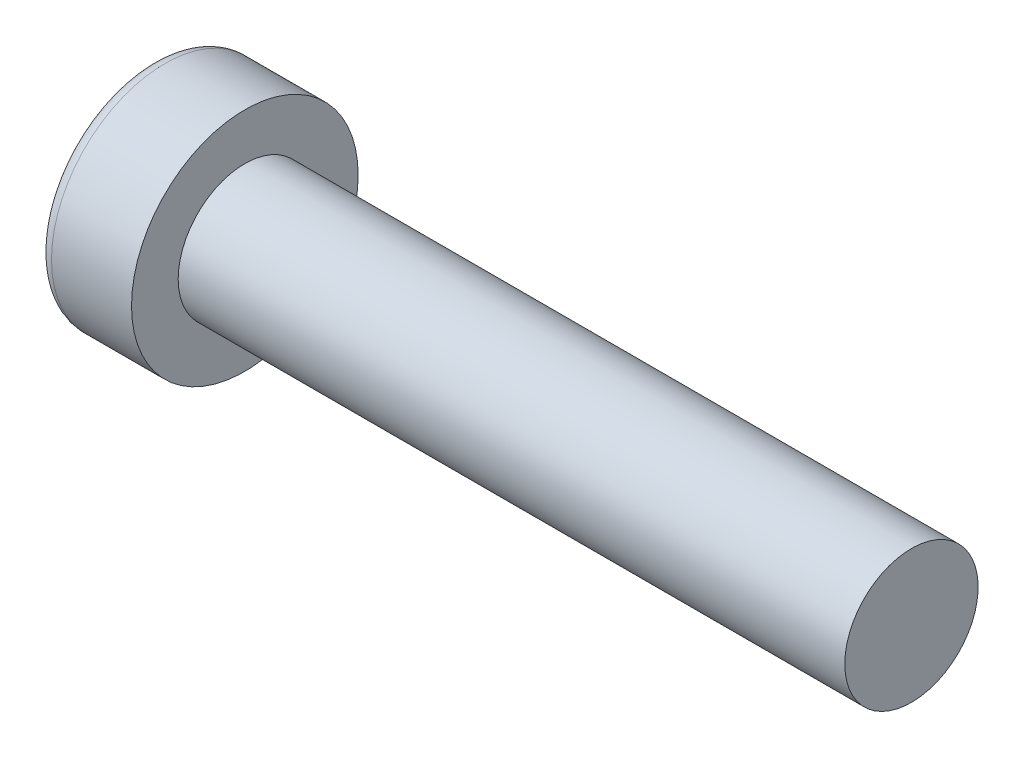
ISO-10303-21;
HEADER;
FILE_DESCRIPTION(('STEP AP214'),'2;1');
FILE_NAME('part.step','',(''),(''),'','','');
FILE_SCHEMA(('AUTOMOTIVE_DESIGN { 1 0 10303 214 1 1 1 1 }'));
ENDSEC;
DATA;
#1=APPLICATION_CONTEXT('core data for automotive mechanical design processes');
#2=APPLICATION_PROTOCOL_DEFINITION('international standard','automotive_design',2000,#1);
#3=PRODUCT_CONTEXT('',#1,'mechanical');
#4=PRODUCT('Part','Part','',(#3));
#5=PRODUCT_RELATED_PRODUCT_CATEGORY('part','',(#4));
#6=PRODUCT_DEFINITION_FORMATION('','',#4);
#7=PRODUCT_DEFINITION_CONTEXT('part definition',#1,'design');
#8=PRODUCT_DEFINITION('design','',#6,#7);
#9=PRODUCT_DEFINITION_SHAPE('','',#8);
#10=(LENGTH_UNIT() NAMED_UNIT(*) SI_UNIT(.MILLI.,.METRE.));
#11=(NAMED_UNIT(*) PLANE_ANGLE_UNIT() SI_UNIT($,.RADIAN.));
#12=(NAMED_UNIT(*) SI_UNIT($,.STERADIAN.) SOLID_ANGLE_UNIT());
#13=UNCERTAINTY_MEASURE_WITH_UNIT(LENGTH_MEASURE(1.E-05),#10,'distance_accuracy_value','');
#14=(GEOMETRIC_REPRESENTATION_CONTEXT(3) GLOBAL_UNCERTAINTY_ASSIGNED_CONTEXT((#13)) GLOBAL_UNIT_ASSIGNED_CONTEXT((#10,
#11,#12)) REPRESENTATION_CONTEXT('',''));
#15=CARTESIAN_POINT('',(0.,0.,0.));
#16=DIRECTION('',(0.,0.,1.));
#17=DIRECTION('',(1.,0.,0.));
#18=AXIS2_PLACEMENT_3D('',#15,#16,#17);
#19=CARTESIAN_POINT('',(-25.,4.25,0.));
#20=DIRECTION('',(-1.,0.,0.));
#21=DIRECTION('',(0.,0.,1.));
#22=AXIS2_PLACEMENT_3D('',#19,#20,#21);
#23=PLANE('',#22);
#24=CARTESIAN_POINT('',(-25.,0.,0.));
#25=DIRECTION('',(-1.,0.,0.));
#26=DIRECTION('',(0.,0.,1.));
#27=AXIS2_PLACEMENT_3D('',#24,#25,#26);
#28=CIRCLE('',#27,4.25);
#29=CARTESIAN_POINT('',(-25.,0.,4.25));
#30=VERTEX_POINT('',#29);
#31=EDGE_CURVE('E148',#30,#30,#28,.T.);
#32=ORIENTED_EDGE('',*,*,#31,.F.);
#33=EDGE_LOOP('',(#32));
#34=FACE_BOUND('',#33,.T.);
#35=CARTESIAN_POINT('',(-25.,0.,0.));
#36=DIRECTION('',(-1.,0.,0.));
#37=DIRECTION('',(0.,0.,1.));
#38=AXIS2_PLACEMENT_3D('',#35,#36,#37);
#39=CIRCLE('',#38,2.5);
#40=CARTESIAN_POINT('',(-25.,0.,2.5));
#41=VERTEX_POINT('',#40);
#42=EDGE_CURVE('E137',#41,#41,#39,.T.);
#43=ORIENTED_EDGE('',*,*,#42,.T.);
#44=EDGE_LOOP('',(#43));
#45=FACE_BOUND('',#44,.T.);
#46=ADVANCED_FACE('F35',(#34,#45),#23,.F.);
#47=CARTESIAN_POINT('',(-65.0118083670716,0.,0.));
#48=DIRECTION('',(-1.,0.,0.));
#49=DIRECTION('',(0.,0.,1.));
#50=AXIS2_PLACEMENT_3D('',#47,#48,#49);
#51=CYLINDRICAL_SURFACE('',#50,4.25);
#52=CARTESIAN_POINT('',(-28.,0.,0.));
#53=DIRECTION('',(1.,0.,0.));
#54=DIRECTION('',(0.,0.,-1.));
#55=AXIS2_PLACEMENT_3D('',#52,#53,#54);
#56=CIRCLE('',#55,4.25);
#57=CARTESIAN_POINT('',(-28.,0.,-4.25));
#58=VERTEX_POINT('',#57);
#59=EDGE_CURVE('E11',#58,#58,#56,.T.);
#60=ORIENTED_EDGE('',*,*,#59,.T.);
#61=EDGE_LOOP('',(#60));
#62=FACE_BOUND('',#61,.T.);
#63=ORIENTED_EDGE('',*,*,#31,.T.);
#64=EDGE_LOOP('',(#63));
#65=FACE_BOUND('',#64,.T.);
#66=ADVANCED_FACE('F170',(#62,#65),#51,.T.);
#67=CARTESIAN_POINT('',(-28.5,0.,0.));
#68=DIRECTION('',(1.,0.,0.));
#69=DIRECTION('',(0.,0.,-1.));
#70=AXIS2_PLACEMENT_3D('',#67,#68,#69);
#71=PLANE('',#70);
#72=DIRECTION('',(0.,0.5,-0.866025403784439));
#73=VECTOR('',#72,1.);
#74=CARTESIAN_POINT('',(-28.5,1.15470053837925,2.));
#75=LINE('',#74,#73);
#76=CARTESIAN_POINT('',(-28.5,1.15470053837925,2.));
#77=VERTEX_POINT('',#76);
#78=CARTESIAN_POINT('',(-28.5,2.3094010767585,0.));
#79=VERTEX_POINT('',#78);
#80=EDGE_CURVE('E124',#77,#79,#75,.T.);
#81=ORIENTED_EDGE('',*,*,#80,.F.);
#82=DIRECTION('',(0.,1.,0.));
#83=VECTOR('',#82,1.);
#84=CARTESIAN_POINT('',(-28.5,-1.15470053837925,2.));
#85=LINE('',#84,#83);
#86=CARTESIAN_POINT('',(-28.5,-1.15470053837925,2.));
#87=VERTEX_POINT('',#86);
#88=EDGE_CURVE('E50',#87,#77,#85,.T.);
#89=ORIENTED_EDGE('',*,*,#88,.F.);
#90=DIRECTION('',(0.,0.5,0.866025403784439));
#91=VECTOR('',#90,1.);
#92=CARTESIAN_POINT('',(-28.5,-2.3094010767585,0.));
#93=LINE('',#92,#91);
#94=CARTESIAN_POINT('',(-28.5,-2.3094010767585,0.));
#95=VERTEX_POINT('',#94);
#96=EDGE_CURVE('E133',#95,#87,#93,.T.);
#97=ORIENTED_EDGE('',*,*,#96,.F.);
#98=DIRECTION('',(0.,-0.5,0.866025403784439));
#99=VECTOR('',#98,1.);
#100=CARTESIAN_POINT('',(-28.5,-1.15470053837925,-2.));
#101=LINE('',#100,#99);
#102=CARTESIAN_POINT('',(-28.5,-1.15470053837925,-2.));
#103=VERTEX_POINT('',#102);
#104=EDGE_CURVE('E131',#103,#95,#101,.T.);
#105=ORIENTED_EDGE('',*,*,#104,.F.);
#106=DIRECTION('',(0.,-1.,0.));
#107=VECTOR('',#106,1.);
#108=CARTESIAN_POINT('',(-28.5,1.15470053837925,-2.));
#109=LINE('',#108,#107);
#110=CARTESIAN_POINT('',(-28.5,1.15470053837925,-2.));
#111=VERTEX_POINT('',#110);
#112=EDGE_CURVE('E98',#111,#103,#109,.T.);
#113=ORIENTED_EDGE('',*,*,#112,.F.);
#114=DIRECTION('',(0.,-0.5,-0.866025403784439));
#115=VECTOR('',#114,1.);
#116=CARTESIAN_POINT('',(-28.5,2.3094010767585,0.));
#117=LINE('',#116,#115);
#118=EDGE_CURVE('E127',#79,#111,#117,.T.);
#119=ORIENTED_EDGE('',*,*,#118,.F.);
#120=EDGE_LOOP('',(#81,#89,#97,#105,#113,#119));
#121=FACE_BOUND('',#120,.T.);
#122=CARTESIAN_POINT('',(-28.5,0.,0.));
#123=DIRECTION('',(1.,0.,0.));
#124=DIRECTION('',(0.,0.,-1.));
#125=AXIS2_PLACEMENT_3D('',#122,#123,#124);
#126=CIRCLE('',#125,3.75);
#127=CARTESIAN_POINT('',(-28.5,0.,-3.75));
#128=VERTEX_POINT('',#127);
#129=EDGE_CURVE('E43',#128,#128,#126,.F.);
#130=ORIENTED_EDGE('',*,*,#129,.T.);
#131=EDGE_LOOP('',(#130));
#132=FACE_BOUND('',#131,.T.);
#133=ADVANCED_FACE('F153',(#121,#132),#71,.F.);
#134=CARTESIAN_POINT('',(0.,2.5,0.));
#135=DIRECTION('',(-1.,0.,0.));
#136=DIRECTION('',(0.,0.,1.));
#137=AXIS2_PLACEMENT_3D('',#134,#135,#136);
#138=PLANE('',#137);
#139=CARTESIAN_POINT('',(0.,0.,0.));
#140=DIRECTION('',(-1.,0.,0.));
#141=DIRECTION('',(0.,0.,1.));
#142=AXIS2_PLACEMENT_3D('',#139,#140,#141);
#143=CIRCLE('',#142,2.5);
#144=CARTESIAN_POINT('',(0.,0.,2.5));
#145=VERTEX_POINT('',#144);
#146=EDGE_CURVE('E145',#145,#145,#143,.T.);
#147=ORIENTED_EDGE('',*,*,#146,.F.);
#148=EDGE_LOOP('',(#147));
#149=FACE_BOUND('',#148,.T.);
#150=ADVANCED_FACE('F165',(#149),#138,.F.);
#151=CARTESIAN_POINT('',(-65.0118083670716,0.,0.));
#152=DIRECTION('',(-1.,0.,0.));
#153=DIRECTION('',(0.,0.,1.));
#154=AXIS2_PLACEMENT_3D('',#151,#152,#153);
#155=CYLINDRICAL_SURFACE('',#154,2.5);
#156=ORIENTED_EDGE('',*,*,#42,.F.);
#157=EDGE_LOOP('',(#156));
#158=FACE_BOUND('',#157,.T.);
#159=ORIENTED_EDGE('',*,*,#146,.T.);
#160=EDGE_LOOP('',(#159));
#161=FACE_BOUND('',#160,.T.);
#162=ADVANCED_FACE('F157',(#158,#161),#155,.T.);
#163=CARTESIAN_POINT('',(-28.,0.,0.));
#164=DIRECTION('',(1.,0.,0.));
#165=DIRECTION('',(0.,0.,-1.));
#166=AXIS2_PLACEMENT_3D('',#163,#164,#165);
#167=TOROIDAL_SURFACE('',#166,3.75,0.5);
#168=ORIENTED_EDGE('',*,*,#59,.F.);
#169=EDGE_LOOP('',(#168));
#170=FACE_BOUND('',#169,.T.);
#171=ORIENTED_EDGE('',*,*,#129,.F.);
#172=EDGE_LOOP('',(#171));
#173=FACE_BOUND('',#172,.T.);
#174=ADVANCED_FACE('F37',(#170,#173),#167,.T.);
#175=CARTESIAN_POINT('',(-25.5,-1.15470053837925,2.));
#176=DIRECTION('',(0.,0.,1.));
#177=DIRECTION('',(1.,0.,0.));
#178=AXIS2_PLACEMENT_3D('',#175,#176,#177);
#179=PLANE('',#178);
#180=ORIENTED_EDGE('',*,*,#88,.T.);
#181=DIRECTION('',(-1.,0.,0.));
#182=VECTOR('',#181,1.);
#183=CARTESIAN_POINT('',(-25.5,1.15470053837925,2.));
#184=LINE('',#183,#182);
#185=CARTESIAN_POINT('',(-25.5,1.15470053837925,2.));
#186=VERTEX_POINT('',#185);
#187=EDGE_CURVE('E80',#186,#77,#184,.T.);
#188=ORIENTED_EDGE('',*,*,#187,.F.);
#189=DIRECTION('',(0.,1.,0.));
#190=VECTOR('',#189,1.);
#191=CARTESIAN_POINT('',(-25.5,-1.15470053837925,2.));
#192=LINE('',#191,#190);
#193=CARTESIAN_POINT('',(-25.5,-1.15470053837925,2.));
#194=VERTEX_POINT('',#193);
#195=EDGE_CURVE('E135',#194,#186,#192,.T.);
#196=ORIENTED_EDGE('',*,*,#195,.F.);
#197=DIRECTION('',(-1.,0.,0.));
#198=VECTOR('',#197,1.);
#199=CARTESIAN_POINT('',(-25.5,-1.15470053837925,2.));
#200=LINE('',#199,#198);
#201=EDGE_CURVE('E58',#194,#87,#200,.T.);
#202=ORIENTED_EDGE('',*,*,#201,.T.);
#203=EDGE_LOOP('',(#180,#188,#196,#202));
#204=FACE_BOUND('',#203,.T.);
#205=ADVANCED_FACE('F156',(#204),#179,.F.);
#206=CARTESIAN_POINT('',(-25.5,-2.3094010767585,0.));
#207=DIRECTION('',(0.,-0.866025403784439,0.5));
#208=DIRECTION('',(0.,-0.5,-0.866025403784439));
#209=AXIS2_PLACEMENT_3D('',#206,#207,#208);
#210=PLANE('',#209);
#211=ORIENTED_EDGE('',*,*,#96,.T.);
#212=ORIENTED_EDGE('',*,*,#201,.F.);
#213=DIRECTION('',(0.,0.5,0.866025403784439));
#214=VECTOR('',#213,1.);
#215=CARTESIAN_POINT('',(-25.5,-2.3094010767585,0.));
#216=LINE('',#215,#214);
#217=CARTESIAN_POINT('',(-25.5,-2.3094010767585,0.));
#218=VERTEX_POINT('',#217);
#219=EDGE_CURVE('E110',#218,#194,#216,.T.);
#220=ORIENTED_EDGE('',*,*,#219,.F.);
#221=DIRECTION('',(-1.,0.,0.));
#222=VECTOR('',#221,1.);
#223=CARTESIAN_POINT('',(-25.5,-2.3094010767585,0.));
#224=LINE('',#223,#222);
#225=EDGE_CURVE('E102',#218,#95,#224,.T.);
#226=ORIENTED_EDGE('',*,*,#225,.T.);
#227=EDGE_LOOP('',(#211,#212,#220,#226));
#228=FACE_BOUND('',#227,.T.);
#229=ADVANCED_FACE('F163',(#228),#210,.F.);
#230=CARTESIAN_POINT('',(-25.5,-1.15470053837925,-2.));
#231=DIRECTION('',(0.,-0.866025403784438,-0.5));
#232=DIRECTION('',(0.,0.5,-0.866025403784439));
#233=AXIS2_PLACEMENT_3D('',#230,#231,#232);
#234=PLANE('',#233);
#235=ORIENTED_EDGE('',*,*,#104,.T.);
#236=ORIENTED_EDGE('',*,*,#225,.F.);
#237=DIRECTION('',(0.,-0.5,0.866025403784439));
#238=VECTOR('',#237,1.);
#239=CARTESIAN_POINT('',(-25.5,-1.15470053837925,-2.));
#240=LINE('',#239,#238);
#241=CARTESIAN_POINT('',(-25.5,-1.15470053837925,-2.));
#242=VERTEX_POINT('',#241);
#243=EDGE_CURVE('E106',#242,#218,#240,.T.);
#244=ORIENTED_EDGE('',*,*,#243,.F.);
#245=DIRECTION('',(-1.,0.,0.));
#246=VECTOR('',#245,1.);
#247=CARTESIAN_POINT('',(-25.5,-1.15470053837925,-2.));
#248=LINE('',#247,#246);
#249=EDGE_CURVE('E91',#242,#103,#248,.T.);
#250=ORIENTED_EDGE('',*,*,#249,.T.);
#251=EDGE_LOOP('',(#235,#236,#244,#250));
#252=FACE_BOUND('',#251,.T.);
#253=ADVANCED_FACE('F107',(#252),#234,.F.);
#254=CARTESIAN_POINT('',(-25.5,1.15470053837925,-2.));
#255=DIRECTION('',(0.,0.,-1.));
#256=DIRECTION('',(0.,1.,0.));
#257=AXIS2_PLACEMENT_3D('',#254,#255,#256);
#258=PLANE('',#257);
#259=ORIENTED_EDGE('',*,*,#112,.T.);
#260=ORIENTED_EDGE('',*,*,#249,.F.);
#261=DIRECTION('',(0.,-1.,0.));
#262=VECTOR('',#261,1.);
#263=CARTESIAN_POINT('',(-25.5,1.15470053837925,-2.));
#264=LINE('',#263,#262);
#265=CARTESIAN_POINT('',(-25.5,1.15470053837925,-2.));
#266=VERTEX_POINT('',#265);
#267=EDGE_CURVE('E95',#266,#242,#264,.T.);
#268=ORIENTED_EDGE('',*,*,#267,.F.);
#269=DIRECTION('',(-1.,0.,0.));
#270=VECTOR('',#269,1.);
#271=CARTESIAN_POINT('',(-25.5,1.15470053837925,-2.));
#272=LINE('',#271,#270);
#273=EDGE_CURVE('E103',#266,#111,#272,.T.);
#274=ORIENTED_EDGE('',*,*,#273,.T.);
#275=EDGE_LOOP('',(#259,#260,#268,#274));
#276=FACE_BOUND('',#275,.T.);
#277=ADVANCED_FACE('F93',(#276),#258,.F.);
#278=CARTESIAN_POINT('',(-25.5,2.3094010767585,0.));
#279=DIRECTION('',(0.,0.866025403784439,-0.5));
#280=DIRECTION('',(0.,0.5,0.866025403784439));
#281=AXIS2_PLACEMENT_3D('',#278,#279,#280);
#282=PLANE('',#281);
#283=ORIENTED_EDGE('',*,*,#118,.T.);
#284=ORIENTED_EDGE('',*,*,#273,.F.);
#285=DIRECTION('',(0.,-0.5,-0.866025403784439));
#286=VECTOR('',#285,1.);
#287=CARTESIAN_POINT('',(-25.5,2.3094010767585,0.));
#288=LINE('',#287,#286);
#289=CARTESIAN_POINT('',(-25.5,2.3094010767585,0.));
#290=VERTEX_POINT('',#289);
#291=EDGE_CURVE('E116',#290,#266,#288,.T.);
#292=ORIENTED_EDGE('',*,*,#291,.F.);
#293=DIRECTION('',(-1.,0.,0.));
#294=VECTOR('',#293,1.);
#295=CARTESIAN_POINT('',(-25.5,2.3094010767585,0.));
#296=LINE('',#295,#294);
#297=EDGE_CURVE('E140',#290,#79,#296,.T.);
#298=ORIENTED_EDGE('',*,*,#297,.T.);
#299=EDGE_LOOP('',(#283,#284,#292,#298));
#300=FACE_BOUND('',#299,.T.);
#301=ADVANCED_FACE('F189',(#300),#282,.F.);
#302=CARTESIAN_POINT('',(-25.5,1.15470053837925,2.));
#303=DIRECTION('',(0.,0.866025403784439,0.5));
#304=DIRECTION('',(0.,-0.5,0.866025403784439));
#305=AXIS2_PLACEMENT_3D('',#302,#303,#304);
#306=PLANE('',#305);
#307=ORIENTED_EDGE('',*,*,#80,.T.);
#308=ORIENTED_EDGE('',*,*,#297,.F.);
#309=DIRECTION('',(0.,0.5,-0.866025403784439));
#310=VECTOR('',#309,1.);
#311=CARTESIAN_POINT('',(-25.5,1.15470053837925,2.));
#312=LINE('',#311,#310);
#313=EDGE_CURVE('E118',#186,#290,#312,.T.);
#314=ORIENTED_EDGE('',*,*,#313,.F.);
#315=ORIENTED_EDGE('',*,*,#187,.T.);
#316=EDGE_LOOP('',(#307,#308,#314,#315));
#317=FACE_BOUND('',#316,.T.);
#318=ADVANCED_FACE('F186',(#317),#306,.F.);
#319=CARTESIAN_POINT('',(-25.5,0.,0.));
#320=DIRECTION('',(-1.,0.,0.));
#321=DIRECTION('',(0.,0.,1.));
#322=AXIS2_PLACEMENT_3D('',#319,#320,#321);
#323=PLANE('',#322);
#324=ORIENTED_EDGE('',*,*,#195,.T.);
#325=ORIENTED_EDGE('',*,*,#313,.T.);
#326=ORIENTED_EDGE('',*,*,#291,.T.);
#327=ORIENTED_EDGE('',*,*,#267,.T.);
#328=ORIENTED_EDGE('',*,*,#243,.T.);
#329=ORIENTED_EDGE('',*,*,#219,.T.);
#330=EDGE_LOOP('',(#324,#325,#326,#327,#328,#329));
#331=FACE_BOUND('',#330,.T.);
#332=ADVANCED_FACE('F113',(#331),#323,.T.);
#333=CLOSED_SHELL('',(#46,#66,#133,#150,#162,#174,#205,#229,#253,#277,#301,#318,#332));
#334=MANIFOLD_SOLID_BREP('B2',#333);
#335=ADVANCED_BREP_SHAPE_REPRESENTATION('',(#18,#334),#14);
#336=SHAPE_DEFINITION_REPRESENTATION(#9,#335);
ENDSEC;
END-ISO-10303-21;
